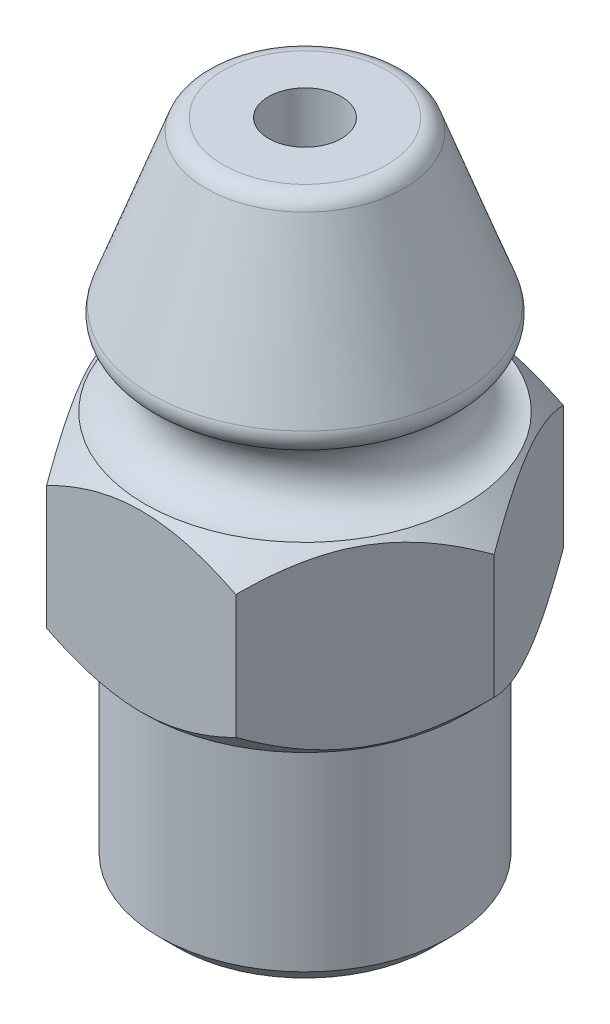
from build123d import *

# Parameters (mm, degrees)
ESQUISSE2_R             = 4
EXTRUSION1_DEPTH        = 6
CHANFREIN1_SIZE         = 0.5
EXTRUSION2_DEPTH        = 5
CONG_2_R                = 0.5
ESQUISSE6_R             = 1
ENL_V_MAT_EXTRU_1_DEPTH = 20.267848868


with BuildPart() as part:
    # Esquisse2 → Extrusion1 (new body)
    with BuildSketch(Plane(origin=(0, 0, 0), x_dir=(1, 0, 0), z_dir=(0, 1, 0))):
        with Locations(Location((0, 0, 0), (0, 0, 270))):
            Circle(ESQUISSE2_R)
    extrude(amount=-EXTRUSION1_DEPTH)

    # Chanfrein1
    chanfrein1_edges = [part.edges().sort_by_distance(p)[0] for p in [
        (0, -6, -4),
    ]]
    chamfer(chanfrein1_edges, length=CHANFREIN1_SIZE)

    # Esquisse3 → Extrusion2 (add)
    with BuildSketch(Plane(origin=(0, 0, 0), x_dir=(-1, 0, 0), z_dir=(0, 1, 0))):
        Polygon((5.196152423, 0), (2.598076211, 4.5), (-2.598076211, 4.5), (-5.196152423, 0), (-2.598076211, -4.5), (2.598076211, -4.5), align=None)
    extrude(amount=EXTRUSION2_DEPTH)

    # Esquisse4 → Enl_vement de mati_re-R_volution1 (revolve, cut)
    with BuildSketch(Plane.XY, mode=Mode.PRIVATE) as enl_vement_de_mati_re_r_volution1_sk:
        Polygon((4.396152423, 5), (5.196152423, 5), (5.196152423, 4.2), align=None)
    enl_vement_de_mati_re_r_volution1 = revolve(enl_vement_de_mati_re_r_volution1_sk.sketch.rotate(Axis((0, -6, 0), (0, 1, 0)), 90), axis=Axis((0, -6, 0), (0, 1, 0)), mode=Mode.SUBTRACT)

    # Sym_trie1: Enl_vement de mati_re-R_volution1 across plane
    add(enl_vement_de_mati_re_r_volution1.mirror(Plane.ZX.offset(2.5)), mode=Mode.SUBTRACT)

    # Esquisse5 → R_volution2 (revolve)
    with BuildSketch(Plane.XY, mode=Mode.PRIVATE) as r_volution2_sk:
        with BuildLine():
            Line((-4.419954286, 6.999716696), (-2.6, 12))
            Line((-2.6, 12), (0, 12))
            Line((0, 12), (0, 5))
            Line((0, 5), (-4.396152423, 5))
            ThreePointArc((-4.396152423, 5), (-3.396223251, 6.011901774), (-4.419954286, 6.999716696))
        make_face()
    revolve(r_volution2_sk.sketch.rotate(Axis((0, 12, 0), (0, -1, 0)), 270), axis=Axis((0, 12, 0), (0, -1, 0)))

    # Cong_2
    cong_2_edges = [part.edges().sort_by_distance(p)[0] for p in [
        (0, 12, -2.6),
        (0, 6.999716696, -4.419954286),
    ]]
    fillet(cong_2_edges, radius=CONG_2_R)

    # Esquisse6 → Enl_v. mat.-Extru.1 (cut, through all)
    with BuildSketch(Plane(origin=(0, 12, 0), x_dir=(-1, 0, 0), z_dir=(0, 1, 0))):
        with Locations(Location((0, 0, 0), (0, 0, 90))):
            Circle(ESQUISSE6_R)
    extrude(amount=-ENL_V_MAT_EXTRU_1_DEPTH, mode=Mode.SUBTRACT)


solid = part.part
